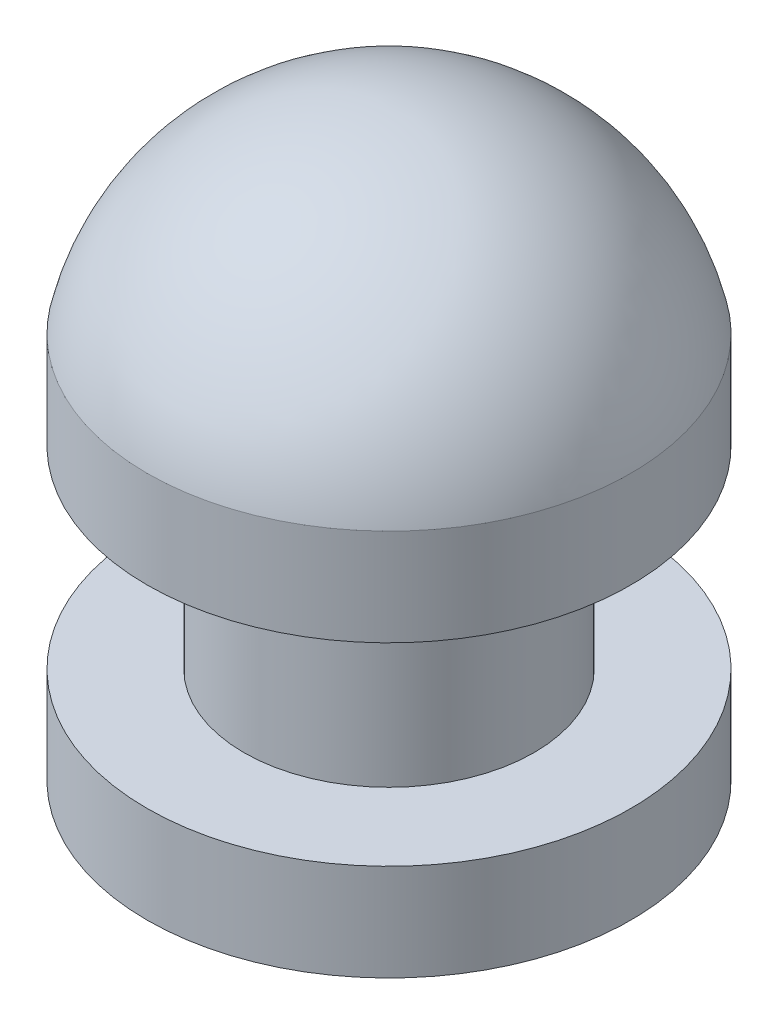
ISO-10303-21;
HEADER;
FILE_DESCRIPTION(('STEP AP214'),'2;1');
FILE_NAME('part.step','',(''),(''),'','','');
FILE_SCHEMA(('AUTOMOTIVE_DESIGN { 1 0 10303 214 1 1 1 1 }'));
ENDSEC;
DATA;
#1=APPLICATION_CONTEXT('core data for automotive mechanical design processes');
#2=APPLICATION_PROTOCOL_DEFINITION('international standard','automotive_design',2000,#1);
#3=PRODUCT_CONTEXT('',#1,'mechanical');
#4=PRODUCT('Part','Part','',(#3));
#5=PRODUCT_RELATED_PRODUCT_CATEGORY('part','',(#4));
#6=PRODUCT_DEFINITION_FORMATION('','',#4);
#7=PRODUCT_DEFINITION_CONTEXT('part definition',#1,'design');
#8=PRODUCT_DEFINITION('design','',#6,#7);
#9=PRODUCT_DEFINITION_SHAPE('','',#8);
#10=(LENGTH_UNIT() NAMED_UNIT(*) SI_UNIT(.MILLI.,.METRE.));
#11=(NAMED_UNIT(*) PLANE_ANGLE_UNIT() SI_UNIT($,.RADIAN.));
#12=(NAMED_UNIT(*) SI_UNIT($,.STERADIAN.) SOLID_ANGLE_UNIT());
#13=UNCERTAINTY_MEASURE_WITH_UNIT(LENGTH_MEASURE(1.E-05),#10,'distance_accuracy_value','');
#14=(GEOMETRIC_REPRESENTATION_CONTEXT(3) GLOBAL_UNCERTAINTY_ASSIGNED_CONTEXT((#13)) GLOBAL_UNIT_ASSIGNED_CONTEXT((#10,
#11,#12)) REPRESENTATION_CONTEXT('',''));
#15=CARTESIAN_POINT('',(0.,0.,0.));
#16=DIRECTION('',(0.,0.,1.));
#17=DIRECTION('',(1.,0.,0.));
#18=AXIS2_PLACEMENT_3D('',#15,#16,#17);
#19=CARTESIAN_POINT('',(0.,0.,0.));
#20=DIRECTION('',(0.,1.,0.));
#21=DIRECTION('',(0.,0.,1.));
#22=AXIS2_PLACEMENT_3D('',#19,#20,#21);
#23=PLANE('',#22);
#24=CARTESIAN_POINT('',(0.,0.,0.));
#25=DIRECTION('',(0.,-1.,0.));
#26=DIRECTION('',(0.,0.,-1.));
#27=AXIS2_PLACEMENT_3D('',#24,#25,#26);
#28=CIRCLE('',#27,12.5);
#29=CARTESIAN_POINT('',(0.,0.,-12.5));
#30=VERTEX_POINT('',#29);
#31=EDGE_CURVE('E10',#30,#30,#28,.T.);
#32=ORIENTED_EDGE('',*,*,#31,.T.);
#33=EDGE_LOOP('',(#32));
#34=FACE_BOUND('',#33,.T.);
#35=ADVANCED_FACE('F29',(#34),#23,.F.);
#36=CARTESIAN_POINT('',(0.,-48.0884440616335,0.));
#37=DIRECTION('',(0.,-1.,0.));
#38=DIRECTION('',(0.,0.,-1.));
#39=AXIS2_PLACEMENT_3D('',#36,#37,#38);
#40=CYLINDRICAL_SURFACE('',#39,12.5);
#41=ORIENTED_EDGE('',*,*,#31,.F.);
#42=EDGE_LOOP('',(#41));
#43=FACE_BOUND('',#42,.T.);
#44=CARTESIAN_POINT('',(0.,5.,0.));
#45=DIRECTION('',(0.,-1.,0.));
#46=DIRECTION('',(0.,0.,-1.));
#47=AXIS2_PLACEMENT_3D('',#44,#45,#46);
#48=CIRCLE('',#47,12.5);
#49=CARTESIAN_POINT('',(0.,5.,-12.5));
#50=VERTEX_POINT('',#49);
#51=EDGE_CURVE('E37',#50,#50,#48,.T.);
#52=ORIENTED_EDGE('',*,*,#51,.T.);
#53=EDGE_LOOP('',(#52));
#54=FACE_BOUND('',#53,.T.);
#55=ADVANCED_FACE('F66',(#43,#54),#40,.T.);
#56=CARTESIAN_POINT('',(-12.5,5.,0.));
#57=DIRECTION('',(0.,-1.,0.));
#58=DIRECTION('',(0.,0.,-1.));
#59=AXIS2_PLACEMENT_3D('',#56,#57,#58);
#60=PLANE('',#59);
#61=ORIENTED_EDGE('',*,*,#51,.F.);
#62=EDGE_LOOP('',(#61));
#63=FACE_BOUND('',#62,.T.);
#64=CARTESIAN_POINT('',(0.,5.,0.));
#65=DIRECTION('',(0.,-1.,0.));
#66=DIRECTION('',(0.,0.,-1.));
#67=AXIS2_PLACEMENT_3D('',#64,#65,#66);
#68=CIRCLE('',#67,7.5);
#69=CARTESIAN_POINT('',(0.,5.,-7.5));
#70=VERTEX_POINT('',#69);
#71=EDGE_CURVE('E41',#70,#70,#68,.T.);
#72=ORIENTED_EDGE('',*,*,#71,.T.);
#73=EDGE_LOOP('',(#72));
#74=FACE_BOUND('',#73,.T.);
#75=ADVANCED_FACE('F70',(#63,#74),#60,.F.);
#76=CARTESIAN_POINT('',(0.,-48.0884440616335,0.));
#77=DIRECTION('',(0.,-1.,0.));
#78=DIRECTION('',(0.,0.,-1.));
#79=AXIS2_PLACEMENT_3D('',#76,#77,#78);
#80=CYLINDRICAL_SURFACE('',#79,7.5);
#81=ORIENTED_EDGE('',*,*,#71,.F.);
#82=EDGE_LOOP('',(#81));
#83=FACE_BOUND('',#82,.T.);
#84=CARTESIAN_POINT('',(0.,15.,0.));
#85=DIRECTION('',(0.,-1.,0.));
#86=DIRECTION('',(0.,0.,-1.));
#87=AXIS2_PLACEMENT_3D('',#84,#85,#86);
#88=CIRCLE('',#87,7.5);
#89=CARTESIAN_POINT('',(0.,15.,-7.5));
#90=VERTEX_POINT('',#89);
#91=EDGE_CURVE('E46',#90,#90,#88,.T.);
#92=ORIENTED_EDGE('',*,*,#91,.T.);
#93=EDGE_LOOP('',(#92));
#94=FACE_BOUND('',#93,.T.);
#95=ADVANCED_FACE('F76',(#83,#94),#80,.T.);
#96=CARTESIAN_POINT('',(-7.5,15.,0.));
#97=DIRECTION('',(0.,1.,0.));
#98=DIRECTION('',(0.,0.,1.));
#99=AXIS2_PLACEMENT_3D('',#96,#97,#98);
#100=PLANE('',#99);
#101=ORIENTED_EDGE('',*,*,#91,.F.);
#102=EDGE_LOOP('',(#101));
#103=FACE_BOUND('',#102,.T.);
#104=CARTESIAN_POINT('',(0.,15.,0.));
#105=DIRECTION('',(0.,-1.,0.));
#106=DIRECTION('',(0.,0.,-1.));
#107=AXIS2_PLACEMENT_3D('',#104,#105,#106);
#108=CIRCLE('',#107,12.5);
#109=CARTESIAN_POINT('',(0.,15.,-12.5));
#110=VERTEX_POINT('',#109);
#111=EDGE_CURVE('E49',#110,#110,#108,.T.);
#112=ORIENTED_EDGE('',*,*,#111,.T.);
#113=EDGE_LOOP('',(#112));
#114=FACE_BOUND('',#113,.T.);
#115=ADVANCED_FACE('F62',(#103,#114),#100,.F.);
#116=CARTESIAN_POINT('',(0.,-48.0884440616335,0.));
#117=DIRECTION('',(0.,-1.,0.));
#118=DIRECTION('',(0.,0.,-1.));
#119=AXIS2_PLACEMENT_3D('',#116,#117,#118);
#120=CYLINDRICAL_SURFACE('',#119,12.5);
#121=ORIENTED_EDGE('',*,*,#111,.F.);
#122=EDGE_LOOP('',(#121));
#123=FACE_BOUND('',#122,.T.);
#124=CARTESIAN_POINT('',(0.,20.,0.));
#125=DIRECTION('',(0.,-1.,0.));
#126=DIRECTION('',(0.,0.,-1.));
#127=AXIS2_PLACEMENT_3D('',#124,#125,#126);
#128=CIRCLE('',#127,12.5);
#129=CARTESIAN_POINT('',(0.,20.,-12.5));
#130=VERTEX_POINT('',#129);
#131=EDGE_CURVE('E33',#130,#130,#128,.T.);
#132=ORIENTED_EDGE('',*,*,#131,.T.);
#133=EDGE_LOOP('',(#132));
#134=FACE_BOUND('',#133,.T.);
#135=ADVANCED_FACE('F56',(#123,#134),#120,.T.);
#136=CARTESIAN_POINT('',(0.,17.1875,0.));
#137=DIRECTION('',(0.,0.,1.));
#138=DIRECTION('',(1.,0.,0.));
#139=AXIS2_PLACEMENT_3D('',#136,#137,#138);
#140=SPHERICAL_SURFACE('',#139,12.8125);
#141=CARTESIAN_POINT('',(0.,17.1875,0.));
#142=DIRECTION('',(0.,-1.,0.));
#143=DIRECTION('',(0.,0.,-1.));
#144=AXIS2_PLACEMENT_3D('',#141,#142,#143);
#145=SPHERICAL_SURFACE('',#144,12.8125);
#146=ORIENTED_EDGE('',*,*,#131,.F.);
#147=EDGE_LOOP('',(#146));
#148=FACE_BOUND('',#147,.T.);
#149=ADVANCED_FACE('F31',(#148),#145,.T.);
#150=CLOSED_SHELL('',(#35,#55,#75,#95,#115,#135,#149));
#151=MANIFOLD_SOLID_BREP('B2',#150);
#152=ADVANCED_BREP_SHAPE_REPRESENTATION('',(#18,#151),#14);
#153=SHAPE_DEFINITION_REPRESENTATION(#9,#152);
ENDSEC;
END-ISO-10303-21;
